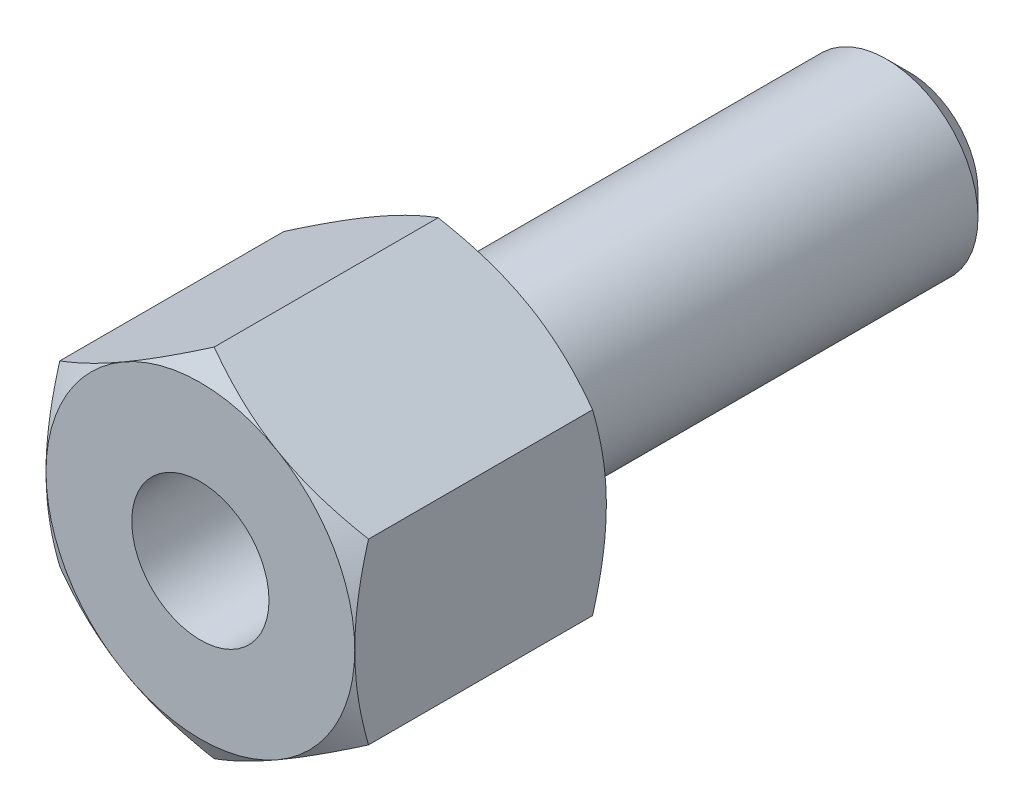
ISO-10303-21;
HEADER;
FILE_DESCRIPTION(('STEP AP214'),'2;1');
FILE_NAME('part.step','',(''),(''),'','','');
FILE_SCHEMA(('AUTOMOTIVE_DESIGN { 1 0 10303 214 1 1 1 1 }'));
ENDSEC;
DATA;
#1=APPLICATION_CONTEXT('core data for automotive mechanical design processes');
#2=APPLICATION_PROTOCOL_DEFINITION('international standard','automotive_design',2000,#1);
#3=PRODUCT_CONTEXT('',#1,'mechanical');
#4=PRODUCT('Part','Part','',(#3));
#5=PRODUCT_RELATED_PRODUCT_CATEGORY('part','',(#4));
#6=PRODUCT_DEFINITION_FORMATION('','',#4);
#7=PRODUCT_DEFINITION_CONTEXT('part definition',#1,'design');
#8=PRODUCT_DEFINITION('design','',#6,#7);
#9=PRODUCT_DEFINITION_SHAPE('','',#8);
#10=(LENGTH_UNIT() NAMED_UNIT(*) SI_UNIT(.MILLI.,.METRE.));
#11=(NAMED_UNIT(*) PLANE_ANGLE_UNIT() SI_UNIT($,.RADIAN.));
#12=(NAMED_UNIT(*) SI_UNIT($,.STERADIAN.) SOLID_ANGLE_UNIT());
#13=UNCERTAINTY_MEASURE_WITH_UNIT(LENGTH_MEASURE(1.E-05),#10,'distance_accuracy_value','');
#14=(GEOMETRIC_REPRESENTATION_CONTEXT(3) GLOBAL_UNCERTAINTY_ASSIGNED_CONTEXT((#13)) GLOBAL_UNIT_ASSIGNED_CONTEXT((#10,
#11,#12)) REPRESENTATION_CONTEXT('',''));
#15=CARTESIAN_POINT('',(0.,0.,0.));
#16=DIRECTION('',(0.,0.,1.));
#17=DIRECTION('',(1.,0.,0.));
#18=AXIS2_PLACEMENT_3D('',#15,#16,#17);
#19=CARTESIAN_POINT('',(13.5,7.79422863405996,22.));
#20=DIRECTION('',(-0.5,-0.866025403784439,0.));
#21=DIRECTION('',(0.866025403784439,-0.5,0.));
#22=AXIS2_PLACEMENT_3D('',#19,#20,#21);
#23=PLANE('',#22);
#24=CARTESIAN_POINT('',(-0.000200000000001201,15.5885727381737,1.20583803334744));
#25=CARTESIAN_POINT('',(0.296524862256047,15.417258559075,1.10693600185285));
#26=CARTESIAN_POINT('',(0.594407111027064,15.2452761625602,1.0125219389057));
#27=CARTESIAN_POINT('',(1.19256027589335,14.899932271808,0.833917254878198));
#28=CARTESIAN_POINT('',(1.49283194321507,14.7265703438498,0.749729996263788));
#29=CARTESIAN_POINT('',(2.09634426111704,14.3781323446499,0.59271056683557));
#30=CARTESIAN_POINT('',(2.39959019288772,14.2030532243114,0.519905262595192));
#31=CARTESIAN_POINT('',(3.00818925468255,13.8516783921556,0.387213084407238));
#32=CARTESIAN_POINT('',(3.31354226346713,13.675382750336,0.327325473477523));
#33=CARTESIAN_POINT('',(3.91853115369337,13.3260922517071,0.223015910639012));
#34=CARTESIAN_POINT('',(4.21812211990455,13.1531233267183,0.178248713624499));
#35=CARTESIAN_POINT('',(4.81867684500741,12.8063928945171,0.103183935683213));
#36=CARTESIAN_POINT('',(5.11964063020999,12.632631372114,0.0728866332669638));
#37=CARTESIAN_POINT('',(5.72207378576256,12.284816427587,0.0275266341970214));
#38=CARTESIAN_POINT('',(6.02354212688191,12.1107635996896,0.0124458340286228));
#39=CARTESIAN_POINT('',(6.62675710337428,11.7624972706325,-0.0021568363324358));
#40=CARTESIAN_POINT('',(6.92850372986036,11.5882837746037,-0.00167918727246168));
#41=CARTESIAN_POINT('',(7.49261810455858,11.262592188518,0.0137483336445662));
#42=CARTESIAN_POINT('',(7.75502605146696,11.1110908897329,0.0268164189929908));
#43=CARTESIAN_POINT('',(8.2792383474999,10.8084367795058,0.0644725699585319));
#44=CARTESIAN_POINT('',(8.54104265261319,10.6572839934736,0.0890614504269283));
#45=CARTESIAN_POINT('',(9.06390546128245,10.3554090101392,0.149330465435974));
#46=CARTESIAN_POINT('',(9.3249631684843,10.2046872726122,0.185019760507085));
#47=CARTESIAN_POINT('',(9.84585469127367,9.90395041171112,0.26686343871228));
#48=CARTESIAN_POINT('',(10.1056884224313,9.7539353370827,0.313018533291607));
#49=CARTESIAN_POINT('',(10.8944281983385,9.29855621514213,0.468349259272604));
#50=CARTESIAN_POINT('',(11.4210501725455,8.99451087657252,0.593013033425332));
#51=CARTESIAN_POINT('',(12.4664415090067,8.39095390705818,0.875948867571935));
#52=CARTESIAN_POINT('',(12.9852242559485,8.09143454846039,1.03415447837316));
#53=CARTESIAN_POINT('',(13.5002,7.79411316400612,1.20583803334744));
#54=B_SPLINE_CURVE_WITH_KNOTS('',3,(#24,#25,#26,#27,#28,#29,#30,#31,#32,#33,#34,#35,#36,#37,#38,
#39,#40,#41,#42,#43,#44,#45,#46,#47,#48,#49,#50,#51,#52,#53),.UNSPECIFIED.,.F.,.F.,(4,2,2,2,2,2,
2,2,2,2,2,2,2,2,4),(0.,1.06987949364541,2.14010980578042,3.21282939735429,4.28548777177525,
5.33167033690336,6.37787303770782,7.42282956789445,8.46775380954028,9.37738732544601,
10.2870851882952,11.1975357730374,12.1080482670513,13.9691139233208,15.8265265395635),.UNSPECIFIED.);
#55=CARTESIAN_POINT('',(0.,15.5884572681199,1.20577136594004));
#56=VERTEX_POINT('',#55);
#57=CARTESIAN_POINT('',(6.75,11.6913429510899,0.));
#58=VERTEX_POINT('',#57);
#59=EDGE_CURVE('E29',#56,#58,#54,.T.);
#60=ORIENTED_EDGE('',*,*,#59,.F.);
#61=DIRECTION('',(0.,0.,-1.));
#62=VECTOR('',#61,1.);
#63=CARTESIAN_POINT('',(0.,15.5884572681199,22.));
#64=LINE('',#63,#62);
#65=CARTESIAN_POINT('',(0.,15.5884572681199,20.79422863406));
#66=VERTEX_POINT('',#65);
#67=EDGE_CURVE('E288',#66,#56,#64,.T.);
#68=ORIENTED_EDGE('',*,*,#67,.F.);
#69=CARTESIAN_POINT('',(13.5002,7.79411316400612,20.7941619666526));
#70=CARTESIAN_POINT('',(13.2034751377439,7.96542734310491,20.8930639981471));
#71=CARTESIAN_POINT('',(12.9055928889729,8.13740973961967,20.9874780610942));
#72=CARTESIAN_POINT('',(12.3074397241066,8.48275363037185,21.1660827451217));
#73=CARTESIAN_POINT('',(12.0071680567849,8.65611555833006,21.2502700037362));
#74=CARTESIAN_POINT('',(11.403655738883,9.00455355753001,21.4072894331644));
#75=CARTESIAN_POINT('',(11.1004098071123,9.17963267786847,21.4800947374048));
#76=CARTESIAN_POINT('',(10.4918107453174,9.53100751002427,21.6127869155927));
#77=CARTESIAN_POINT('',(10.1864577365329,9.70730315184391,21.6726745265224));
#78=CARTESIAN_POINT('',(9.58146884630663,10.0565936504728,21.7769840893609));
#79=CARTESIAN_POINT('',(9.28187788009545,10.2295625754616,21.8217512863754));
#80=CARTESIAN_POINT('',(8.68132315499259,10.5762930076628,21.8968160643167));
#81=CARTESIAN_POINT('',(8.38035936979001,10.7500545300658,21.927113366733));
#82=CARTESIAN_POINT('',(7.77792621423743,11.0978694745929,21.9724733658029));
#83=CARTESIAN_POINT('',(7.47645787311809,11.2719223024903,21.9875541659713));
#84=CARTESIAN_POINT('',(6.87324289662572,11.6201886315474,22.0021568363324));
#85=CARTESIAN_POINT('',(6.57149627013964,11.7944021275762,22.0016791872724));
#86=CARTESIAN_POINT('',(6.00738189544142,12.1200937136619,21.9862516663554));
#87=CARTESIAN_POINT('',(5.74497394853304,12.271595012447,21.973183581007));
#88=CARTESIAN_POINT('',(5.22076165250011,12.5742491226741,21.9355274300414));
#89=CARTESIAN_POINT('',(4.95895734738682,12.7254019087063,21.910938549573));
#90=CARTESIAN_POINT('',(4.43609453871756,13.0272768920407,21.850669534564));
#91=CARTESIAN_POINT('',(4.17503683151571,13.1779986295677,21.8149802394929));
#92=CARTESIAN_POINT('',(3.65414530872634,13.4787354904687,21.7331365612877));
#93=CARTESIAN_POINT('',(3.39431157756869,13.6287505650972,21.6869814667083));
#94=CARTESIAN_POINT('',(2.60557180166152,14.0841296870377,21.5316507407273));
#95=CARTESIAN_POINT('',(2.07894982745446,14.3881750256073,21.4069869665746));
#96=CARTESIAN_POINT('',(1.03355849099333,14.9917319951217,21.124051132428));
#97=CARTESIAN_POINT('',(0.514775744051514,15.2912513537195,20.9658455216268));
#98=CARTESIAN_POINT('',(-0.000200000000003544,15.5885727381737,20.7941619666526));
#99=B_SPLINE_CURVE_WITH_KNOTS('',3,(#69,#70,#71,#72,#73,#74,#75,#76,#77,#78,#79,#80,#81,#82,#83,
#84,#85,#86,#87,#88,#89,#90,#91,#92,#93,#94,#95,#96,#97,#98),.UNSPECIFIED.,.F.,.F.,(4,2,2,2,2,2,
2,2,2,2,2,2,2,2,4),(0.,1.0698794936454,2.14010980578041,3.21282939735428,4.28548777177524,
5.33167033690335,6.37787303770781,7.42282956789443,8.46775380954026,9.37738732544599,
10.2870851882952,11.1975357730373,12.1080482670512,13.9691139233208,15.8265265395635),.UNSPECIFIED.);
#100=CARTESIAN_POINT('',(6.75,11.6913429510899,22.));
#101=VERTEX_POINT('',#100);
#102=EDGE_CURVE('E219',#101,#66,#99,.T.);
#103=ORIENTED_EDGE('',*,*,#102,.F.);
#104=CARTESIAN_POINT('',(13.5,7.79422863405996,20.79422863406));
#105=VERTEX_POINT('',#104);
#106=EDGE_CURVE('E224',#105,#101,#99,.T.);
#107=ORIENTED_EDGE('',*,*,#106,.F.);
#108=DIRECTION('',(0.,0.,-1.));
#109=VECTOR('',#108,1.);
#110=CARTESIAN_POINT('',(13.5,7.79422863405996,22.));
#111=LINE('',#110,#109);
#112=CARTESIAN_POINT('',(13.5,7.79422863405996,1.20577136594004));
#113=VERTEX_POINT('',#112);
#114=EDGE_CURVE('E282',#105,#113,#111,.T.);
#115=ORIENTED_EDGE('',*,*,#114,.T.);
#116=EDGE_CURVE('E111',#58,#113,#54,.T.);
#117=ORIENTED_EDGE('',*,*,#116,.F.);
#118=EDGE_LOOP('',(#60,#68,#103,#107,#115,#117));
#119=FACE_BOUND('',#118,.T.);
#120=ADVANCED_FACE('F14',(#119),#23,.F.);
#121=CARTESIAN_POINT('',(13.5,-7.79422863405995,22.));
#122=DIRECTION('',(-1.,0.,0.));
#123=DIRECTION('',(0.,-1.,0.));
#124=AXIS2_PLACEMENT_3D('',#121,#122,#123);
#125=PLANE('',#124);
#126=CARTESIAN_POINT('',(13.5,-21.331355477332,6.78059814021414));
#127=CARTESIAN_POINT('',(13.5,-21.0348415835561,6.63594408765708));
#128=CARTESIAN_POINT('',(13.5,-20.7379902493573,6.49198204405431));
#129=CARTESIAN_POINT('',(13.5,-20.1435424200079,6.20559795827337));
#130=CARTESIAN_POINT('',(13.5,-19.8459459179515,6.06317593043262));
#131=CARTESIAN_POINT('',(13.5,-18.9518592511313,5.63841878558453));
#132=CARTESIAN_POINT('',(13.5,-18.3541537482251,5.35863262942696));
#133=CARTESIAN_POINT('',(13.5,-17.1518047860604,4.80605287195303));
#134=CARTESIAN_POINT('',(13.5,-16.5471414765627,4.53330236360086));
#135=CARTESIAN_POINT('',(13.5,-15.3331426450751,3.99844293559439));
#136=CARTESIAN_POINT('',(13.5,-14.7238073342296,3.73633353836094));
#137=CARTESIAN_POINT('',(13.5,-13.4783398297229,3.21673295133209));
#138=CARTESIAN_POINT('',(13.5,-12.8420094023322,2.95971454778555));
#139=CARTESIAN_POINT('',(13.5,-11.5620466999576,2.46418926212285));
#140=CARTESIAN_POINT('',(13.5,-10.9184136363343,2.22568440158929));
#141=CARTESIAN_POINT('',(13.5,-9.6239242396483,1.77316412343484));
#142=CARTESIAN_POINT('',(13.5,-8.97308423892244,1.5591023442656));
#143=CARTESIAN_POINT('',(13.5,-7.6620162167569,1.16206050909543));
#144=CARTESIAN_POINT('',(13.5,-7.00179109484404,0.979071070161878));
#145=CARTESIAN_POINT('',(13.5,-6.00612300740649,0.734821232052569));
#146=CARTESIAN_POINT('',(13.5,-5.67432480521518,0.658623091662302));
#147=CARTESIAN_POINT('',(13.5,-5.00839149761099,0.517171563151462));
#148=CARTESIAN_POINT('',(13.5,-4.67425643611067,0.451917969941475));
#149=CARTESIAN_POINT('',(13.5,-4.00385058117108,0.333481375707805));
#150=CARTESIAN_POINT('',(13.5,-3.66757983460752,0.280298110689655));
#151=CARTESIAN_POINT('',(13.5,-2.99322771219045,0.1870468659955));
#152=CARTESIAN_POINT('',(13.5,-2.65514641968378,0.146978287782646));
#153=CARTESIAN_POINT('',(13.5,-1.98222745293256,0.081277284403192));
#154=CARTESIAN_POINT('',(13.5,-1.64740837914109,0.0554555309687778));
#155=CARTESIAN_POINT('',(13.5,-0.976977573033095,0.0180091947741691));
#156=CARTESIAN_POINT('',(13.5,-0.641365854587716,0.00638436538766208));
#157=CARTESIAN_POINT('',(13.5,0.0300490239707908,-0.00238931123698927));
#158=CARTESIAN_POINT('',(13.5,0.365852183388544,0.00046178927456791));
#159=CARTESIAN_POINT('',(13.5,1.03703053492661,0.0205660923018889));
#160=CARTESIAN_POINT('',(13.5,1.37240570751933,0.0378199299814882));
#161=CARTESIAN_POINT('',(13.5,2.16676258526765,0.0953698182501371));
#162=CARTESIAN_POINT('',(13.5,2.6253067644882,0.141850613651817));
#163=CARTESIAN_POINT('',(13.5,3.53922491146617,0.259287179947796));
#164=CARTESIAN_POINT('',(13.5,3.99459848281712,0.330245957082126));
#165=CARTESIAN_POINT('',(13.5,5.35531317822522,0.57609614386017));
#166=CARTESIAN_POINT('',(13.5,6.25479537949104,0.78392404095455));
#167=CARTESIAN_POINT('',(13.5,7.60029912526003,1.14728943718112));
#168=CARTESIAN_POINT('',(13.5,8.05321725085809,1.27878575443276));
#169=CARTESIAN_POINT('',(13.5,8.95466371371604,1.55618422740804));
#170=CARTESIAN_POINT('',(13.5,9.40319201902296,1.70208648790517));
#171=CARTESIAN_POINT('',(13.5,10.295985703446,2.00589462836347));
#172=CARTESIAN_POINT('',(13.5,10.7402522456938,2.16379712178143));
#173=CARTESIAN_POINT('',(13.5,11.6250550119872,2.48967378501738));
#174=CARTESIAN_POINT('',(13.5,12.0655913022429,2.65764777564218));
#175=CARTESIAN_POINT('',(13.5,13.183719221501,3.09631129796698));
#176=CARTESIAN_POINT('',(13.5,13.8590041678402,3.37287276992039));
#177=CARTESIAN_POINT('',(13.5,15.203081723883,3.9413978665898));
#178=CARTESIAN_POINT('',(13.5,15.8718737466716,4.23336286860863));
#179=CARTESIAN_POINT('',(13.5,17.2043213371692,4.82931020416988));
#180=CARTESIAN_POINT('',(13.5,17.8679751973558,5.13329634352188));
#181=CARTESIAN_POINT('',(13.5,19.1908824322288,5.75061518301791));
#182=CARTESIAN_POINT('',(13.5,19.8501359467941,6.06394758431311));
#183=CARTESIAN_POINT('',(13.5,21.1659794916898,6.69850180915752));
#184=CARTESIAN_POINT('',(13.5,21.8225644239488,7.01973418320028));
#185=CARTESIAN_POINT('',(13.5,23.1327602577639,7.66820869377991));
#186=CARTESIAN_POINT('',(13.5,23.78637114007,7.99545086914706));
#187=CARTESIAN_POINT('',(13.5,25.0909986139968,8.65477087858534));
#188=CARTESIAN_POINT('',(13.5,25.742015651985,8.98684783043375));
#189=CARTESIAN_POINT('',(13.5,27.0419705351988,9.655038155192));
#190=CARTESIAN_POINT('',(13.5,27.6909083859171,9.9911515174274));
#191=CARTESIAN_POINT('',(13.5,29.5104700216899,10.9395467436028));
#192=CARTESIAN_POINT('',(13.5,30.6791164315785,11.5556218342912));
#193=CARTESIAN_POINT('',(13.5,33.0122022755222,12.7958093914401));
#194=CARTESIAN_POINT('',(13.5,34.1766414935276,13.4199222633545));
#195=CARTESIAN_POINT('',(13.5,36.4986615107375,14.6722739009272));
#196=CARTESIAN_POINT('',(13.5,37.6562523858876,15.3004939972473));
#197=CARTESIAN_POINT('',(13.5,39.3906904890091,16.2462971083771));
#198=CARTESIAN_POINT('',(13.5,39.9684919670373,16.5621327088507));
#199=CARTESIAN_POINT('',(13.5,41.1235248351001,17.194842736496));
#200=CARTESIAN_POINT('',(13.5,41.7007562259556,17.5117171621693));
#201=CARTESIAN_POINT('',(13.5,42.2777363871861,17.8290485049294));
#202=B_SPLINE_CURVE_WITH_KNOTS('',3,(#126,#127,#128,#129,#130,#131,#132,#133,#134,#135,#136,
#137,#138,#139,#140,#141,#142,#143,#144,#145,#146,#147,#148,#149,#150,#151,#152,#153,#154,#155,
#156,#157,#158,#159,#160,#161,#162,#163,#164,#165,#166,#167,#168,#169,#170,#171,#172,#173,#174,
#175,#176,#177,#178,#179,#180,#181,#182,#183,#184,#185,#186,#187,#188,#189,#190,#191,#192,#193,
#194,#195,#196,#197,#198,#199,#200,#201),.UNSPECIFIED.,.F.,.F.,(4,2,2,2,2,2,2,2,2,2,2,2,2,2,2,2,
2,2,2,2,2,2,2,2,2,2,2,2,2,2,2,2,2,2,2,2,2,4),(0.,0.98974959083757,1.9795083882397,
3.95929922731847,5.94921788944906,7.93904714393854,9.99765533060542,12.0564879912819,
14.1113483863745,16.1655871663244,17.186741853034,18.2078774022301,19.2289906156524,
20.2500572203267,21.2572061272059,22.2643375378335,23.2714653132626,24.2786375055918,
25.6605465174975,27.0426253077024,29.8081400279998,31.2228732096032,32.6376166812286,
34.0519623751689,35.4662829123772,37.6551800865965,39.8442733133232,42.0340652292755,
44.2237872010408,46.416612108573,48.6094511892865,50.8018950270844,52.994333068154,
56.9575595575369,60.9209867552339,64.8721862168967,66.8476499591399,68.8231108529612),.UNSPECIFIED.);
#203=CARTESIAN_POINT('',(13.5,0.,0.));
#204=VERTEX_POINT('',#203);
#205=EDGE_CURVE('E104',#113,#204,#202,.F.);
#206=ORIENTED_EDGE('',*,*,#205,.F.);
#207=ORIENTED_EDGE('',*,*,#114,.F.);
#208=CARTESIAN_POINT('',(13.5,-21.331355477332,15.2194018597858));
#209=CARTESIAN_POINT('',(13.5,-21.0348415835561,15.3640559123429));
#210=CARTESIAN_POINT('',(13.5,-20.7379902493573,15.5080179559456));
#211=CARTESIAN_POINT('',(13.5,-20.1435424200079,15.7944020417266));
#212=CARTESIAN_POINT('',(13.5,-19.8459459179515,15.9368240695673));
#213=CARTESIAN_POINT('',(13.5,-18.9518592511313,16.3615812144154));
#214=CARTESIAN_POINT('',(13.5,-18.3541537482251,16.641367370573));
#215=CARTESIAN_POINT('',(13.5,-17.1518047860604,17.1939471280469));
#216=CARTESIAN_POINT('',(13.5,-16.5471414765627,17.4666976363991));
#217=CARTESIAN_POINT('',(13.5,-15.333142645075,18.0015570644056));
#218=CARTESIAN_POINT('',(13.5,-14.7238073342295,18.263666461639));
#219=CARTESIAN_POINT('',(13.5,-13.4783398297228,18.7832670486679));
#220=CARTESIAN_POINT('',(13.5,-12.8420094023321,19.0402854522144));
#221=CARTESIAN_POINT('',(13.5,-11.5620466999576,19.5358107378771));
#222=CARTESIAN_POINT('',(13.5,-10.9184136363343,19.7743155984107));
#223=CARTESIAN_POINT('',(13.5,-9.62392423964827,20.2268358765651));
#224=CARTESIAN_POINT('',(13.5,-8.9730842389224,20.4408976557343));
#225=CARTESIAN_POINT('',(13.5,-7.66201621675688,20.8379394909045));
#226=CARTESIAN_POINT('',(13.5,-7.00179109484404,21.0209289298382));
#227=CARTESIAN_POINT('',(13.5,-6.00612300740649,21.2651787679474));
#228=CARTESIAN_POINT('',(13.5,-5.67432480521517,21.3413769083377));
#229=CARTESIAN_POINT('',(13.5,-5.00839149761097,21.4828284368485));
#230=CARTESIAN_POINT('',(13.5,-4.67425643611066,21.5480820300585));
#231=CARTESIAN_POINT('',(13.5,-4.00385058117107,21.6665186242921));
#232=CARTESIAN_POINT('',(13.5,-3.66757983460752,21.7197018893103));
#233=CARTESIAN_POINT('',(13.5,-2.99322771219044,21.8129531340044));
#234=CARTESIAN_POINT('',(13.5,-2.65514641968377,21.8530217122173));
#235=CARTESIAN_POINT('',(13.5,-1.98222745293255,21.9187227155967));
#236=CARTESIAN_POINT('',(13.5,-1.64740837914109,21.9445444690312));
#237=CARTESIAN_POINT('',(13.5,-0.976977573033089,21.9819908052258));
#238=CARTESIAN_POINT('',(13.5,-0.641365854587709,21.9936156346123));
#239=CARTESIAN_POINT('',(13.5,0.0300490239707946,22.0023893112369));
#240=CARTESIAN_POINT('',(13.5,0.365852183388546,21.9995382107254));
#241=CARTESIAN_POINT('',(13.5,1.03703053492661,21.9794339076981));
#242=CARTESIAN_POINT('',(13.5,1.37240570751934,21.9621800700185));
#243=CARTESIAN_POINT('',(13.5,2.16676258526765,21.9046301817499));
#244=CARTESIAN_POINT('',(13.5,2.62530676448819,21.8581493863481));
#245=CARTESIAN_POINT('',(13.5,3.53922491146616,21.7407128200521));
#246=CARTESIAN_POINT('',(13.5,3.9945984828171,21.6697540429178));
#247=CARTESIAN_POINT('',(13.5,5.3553131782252,21.4239038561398));
#248=CARTESIAN_POINT('',(13.5,6.25479537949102,21.2160759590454));
#249=CARTESIAN_POINT('',(13.5,7.60029912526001,20.8527105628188));
#250=CARTESIAN_POINT('',(13.5,8.05321725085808,20.7212142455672));
#251=CARTESIAN_POINT('',(13.5,8.95466371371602,20.4438157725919));
#252=CARTESIAN_POINT('',(13.5,9.40319201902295,20.2979135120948));
#253=CARTESIAN_POINT('',(13.5,10.295985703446,19.9941053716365));
#254=CARTESIAN_POINT('',(13.5,10.7402522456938,19.8362028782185));
#255=CARTESIAN_POINT('',(13.5,11.6250550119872,19.5103262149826));
#256=CARTESIAN_POINT('',(13.5,12.0655913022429,19.3423522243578));
#257=CARTESIAN_POINT('',(13.5,13.183719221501,18.9036887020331));
#258=CARTESIAN_POINT('',(13.5,13.8590041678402,18.6271272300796));
#259=CARTESIAN_POINT('',(13.5,15.203081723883,18.0586021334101));
#260=CARTESIAN_POINT('',(13.5,15.8718737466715,17.7666371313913));
#261=CARTESIAN_POINT('',(13.5,17.2043213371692,17.1706897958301));
#262=CARTESIAN_POINT('',(13.5,17.8679751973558,16.8667036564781));
#263=CARTESIAN_POINT('',(13.5,19.1908824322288,16.2493848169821));
#264=CARTESIAN_POINT('',(13.5,19.850135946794,15.9360524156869));
#265=CARTESIAN_POINT('',(13.5,21.1659794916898,15.3014981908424));
#266=CARTESIAN_POINT('',(13.5,21.8225644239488,14.9802658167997));
#267=CARTESIAN_POINT('',(13.5,23.1327602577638,14.3317913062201));
#268=CARTESIAN_POINT('',(13.5,23.7863711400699,14.0045491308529));
#269=CARTESIAN_POINT('',(13.5,25.0909986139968,13.3452291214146));
#270=CARTESIAN_POINT('',(13.5,25.742015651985,13.0131521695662));
#271=CARTESIAN_POINT('',(13.5,27.0419705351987,12.344961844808));
#272=CARTESIAN_POINT('',(13.5,27.6909083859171,12.0088484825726));
#273=CARTESIAN_POINT('',(13.5,29.5104700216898,11.0604532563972));
#274=CARTESIAN_POINT('',(13.5,30.6791164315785,10.4443781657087));
#275=CARTESIAN_POINT('',(13.5,33.0122022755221,9.20419060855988));
#276=CARTESIAN_POINT('',(13.5,34.1766414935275,8.58007773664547));
#277=CARTESIAN_POINT('',(13.5,36.4986615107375,7.32772609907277));
#278=CARTESIAN_POINT('',(13.5,37.6562523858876,6.69950600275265));
#279=CARTESIAN_POINT('',(13.5,39.3906904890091,5.7537028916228));
#280=CARTESIAN_POINT('',(13.5,39.9684919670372,5.43786729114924));
#281=CARTESIAN_POINT('',(13.5,41.1235248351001,4.8051572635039));
#282=CARTESIAN_POINT('',(13.5,41.7007562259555,4.48828283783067));
#283=CARTESIAN_POINT('',(13.5,42.2777363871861,4.17095149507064));
#284=B_SPLINE_CURVE_WITH_KNOTS('',3,(#208,#209,#210,#211,#212,#213,#214,#215,#216,#217,#218,
#219,#220,#221,#222,#223,#224,#225,#226,#227,#228,#229,#230,#231,#232,#233,#234,#235,#236,#237,
#238,#239,#240,#241,#242,#243,#244,#245,#246,#247,#248,#249,#250,#251,#252,#253,#254,#255,#256,
#257,#258,#259,#260,#261,#262,#263,#264,#265,#266,#267,#268,#269,#270,#271,#272,#273,#274,#275,
#276,#277,#278,#279,#280,#281,#282,#283),.UNSPECIFIED.,.F.,.F.,(4,2,2,2,2,2,2,2,2,2,2,2,2,2,2,2,
2,2,2,2,2,2,2,2,2,2,2,2,2,2,2,2,2,2,2,2,2,4),(0.,0.989749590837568,1.9795083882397,
3.95929922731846,5.94921788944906,7.93904714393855,9.99765533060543,12.0564879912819,
14.1113483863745,16.1655871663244,17.186741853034,18.2078774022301,19.2289906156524,
20.2500572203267,21.2572061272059,22.2643375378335,23.2714653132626,24.2786375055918,
25.6605465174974,27.0426253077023,29.8081400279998,31.2228732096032,32.6376166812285,
34.0519623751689,35.4662829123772,37.6551800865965,39.8442733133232,42.0340652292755,
44.2237872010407,46.4166121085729,48.6094511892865,50.8018950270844,52.9943330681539,
56.9575595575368,60.9209867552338,64.8721862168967,66.8476499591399,68.8231108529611),.UNSPECIFIED.);
#285=CARTESIAN_POINT('',(13.5,0.,22.));
#286=VERTEX_POINT('',#285);
#287=EDGE_CURVE('E170',#286,#105,#284,.T.);
#288=ORIENTED_EDGE('',*,*,#287,.F.);
#289=CARTESIAN_POINT('',(13.5,-7.79422863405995,20.79422863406));
#290=VERTEX_POINT('',#289);
#291=EDGE_CURVE('E177',#290,#286,#284,.T.);
#292=ORIENTED_EDGE('',*,*,#291,.F.);
#293=DIRECTION('',(0.,0.,-1.));
#294=VECTOR('',#293,1.);
#295=CARTESIAN_POINT('',(13.5,-7.79422863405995,22.));
#296=LINE('',#295,#294);
#297=CARTESIAN_POINT('',(13.5,-7.79422863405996,1.20577136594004));
#298=VERTEX_POINT('',#297);
#299=EDGE_CURVE('E136',#290,#298,#296,.T.);
#300=ORIENTED_EDGE('',*,*,#299,.T.);
#301=EDGE_CURVE('E116',#204,#298,#202,.F.);
#302=ORIENTED_EDGE('',*,*,#301,.F.);
#303=EDGE_LOOP('',(#206,#207,#288,#292,#300,#302));
#304=FACE_BOUND('',#303,.T.);
#305=ADVANCED_FACE('F133',(#304),#125,.F.);
#306=CARTESIAN_POINT('',(0.,-15.5884572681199,22.));
#307=DIRECTION('',(-0.5,0.866025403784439,0.));
#308=DIRECTION('',(-0.866025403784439,-0.5,0.));
#309=AXIS2_PLACEMENT_3D('',#306,#307,#308);
#310=PLANE('',#309);
#311=CARTESIAN_POINT('',(13.5002,-7.79411316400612,1.20583803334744));
#312=CARTESIAN_POINT('',(13.203475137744,-7.9654273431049,1.10693600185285));
#313=CARTESIAN_POINT('',(12.9055928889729,-8.13740973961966,1.0125219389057));
#314=CARTESIAN_POINT('',(12.3074397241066,-8.48275363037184,0.833917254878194));
#315=CARTESIAN_POINT('',(12.0071680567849,-8.65611555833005,0.749729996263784));
#316=CARTESIAN_POINT('',(11.403655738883,-9.00455355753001,0.592710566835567));
#317=CARTESIAN_POINT('',(11.1004098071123,-9.17963267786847,0.519905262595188));
#318=CARTESIAN_POINT('',(10.4918107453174,-9.53100751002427,0.387213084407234));
#319=CARTESIAN_POINT('',(10.1864577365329,-9.7073031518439,0.327325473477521));
#320=CARTESIAN_POINT('',(9.58146884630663,-10.0565936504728,0.22301591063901));
#321=CARTESIAN_POINT('',(9.28187788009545,-10.2295625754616,0.178248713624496));
#322=CARTESIAN_POINT('',(8.68132315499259,-10.5762930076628,0.103183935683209));
#323=CARTESIAN_POINT('',(8.38035936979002,-10.7500545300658,0.0728866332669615));
#324=CARTESIAN_POINT('',(7.77792621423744,-11.0978694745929,0.0275266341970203));
#325=CARTESIAN_POINT('',(7.4764578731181,-11.2719223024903,0.0124458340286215));
#326=CARTESIAN_POINT('',(6.87324289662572,-11.6201886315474,-0.00215683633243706));
#327=CARTESIAN_POINT('',(6.57149627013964,-11.7944021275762,-0.00167918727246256));
#328=CARTESIAN_POINT('',(6.00738189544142,-12.1200937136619,0.0137483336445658));
#329=CARTESIAN_POINT('',(5.74497394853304,-12.271595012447,0.0268164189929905));
#330=CARTESIAN_POINT('',(5.2207616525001,-12.5742491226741,0.0644725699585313));
#331=CARTESIAN_POINT('',(4.95895734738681,-12.7254019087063,0.0890614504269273));
#332=CARTESIAN_POINT('',(4.43609453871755,-13.0272768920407,0.149330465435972));
#333=CARTESIAN_POINT('',(4.1750368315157,-13.1779986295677,0.185019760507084));
#334=CARTESIAN_POINT('',(3.65414530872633,-13.4787354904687,0.266863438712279));
#335=CARTESIAN_POINT('',(3.39431157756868,-13.6287505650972,0.313018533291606));
#336=CARTESIAN_POINT('',(2.60557180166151,-14.0841296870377,0.468349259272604));
#337=CARTESIAN_POINT('',(2.07894982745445,-14.3881750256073,0.593013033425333));
#338=CARTESIAN_POINT('',(1.03355849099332,-14.9917319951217,0.875948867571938));
#339=CARTESIAN_POINT('',(0.514775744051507,-15.2912513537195,1.03415447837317));
#340=CARTESIAN_POINT('',(-0.000200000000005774,-15.5885727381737,1.20583803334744));
#341=B_SPLINE_CURVE_WITH_KNOTS('',3,(#311,#312,#313,#314,#315,#316,#317,#318,#319,#320,#321,
#322,#323,#324,#325,#326,#327,#328,#329,#330,#331,#332,#333,#334,#335,#336,#337,#338,#339,#340),
.UNSPECIFIED.,.F.,.F.,(4,2,2,2,2,2,2,2,2,2,2,2,2,2,4),(0.,1.06987949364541,2.14010980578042,
3.21282939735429,4.28548777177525,5.33167033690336,6.37787303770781,7.42282956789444,
8.46775380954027,9.377387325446,10.2870851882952,11.1975357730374,12.1080482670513,
13.9691139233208,15.8265265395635),.UNSPECIFIED.);
#342=CARTESIAN_POINT('',(6.75,-11.6913429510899,0.));
#343=VERTEX_POINT('',#342);
#344=EDGE_CURVE('E123',#298,#343,#341,.T.);
#345=ORIENTED_EDGE('',*,*,#344,.F.);
#346=ORIENTED_EDGE('',*,*,#299,.F.);
#347=CARTESIAN_POINT('',(-0.000200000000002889,-15.5885727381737,20.7941619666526));
#348=CARTESIAN_POINT('',(0.29652486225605,-15.417258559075,20.8930639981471));
#349=CARTESIAN_POINT('',(0.594407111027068,-15.2452761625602,20.9874780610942));
#350=CARTESIAN_POINT('',(1.19256027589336,-14.899932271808,21.1660827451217));
#351=CARTESIAN_POINT('',(1.49283194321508,-14.7265703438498,21.2502700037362));
#352=CARTESIAN_POINT('',(2.09634426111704,-14.3781323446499,21.4072894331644));
#353=CARTESIAN_POINT('',(2.39959019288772,-14.2030532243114,21.4800947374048));
#354=CARTESIAN_POINT('',(3.00818925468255,-13.8516783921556,21.6127869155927));
#355=CARTESIAN_POINT('',(3.31354226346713,-13.675382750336,21.6726745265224));
#356=CARTESIAN_POINT('',(3.91853115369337,-13.3260922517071,21.7769840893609));
#357=CARTESIAN_POINT('',(4.21812211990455,-13.1531233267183,21.8217512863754));
#358=CARTESIAN_POINT('',(4.81867684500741,-12.8063928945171,21.8968160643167));
#359=CARTESIAN_POINT('',(5.11964063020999,-12.632631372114,21.927113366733));
#360=CARTESIAN_POINT('',(5.72207378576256,-12.284816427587,21.9724733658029));
#361=CARTESIAN_POINT('',(6.0235421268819,-12.1107635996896,21.9875541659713));
#362=CARTESIAN_POINT('',(6.62675710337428,-11.7624972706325,22.0021568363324));
#363=CARTESIAN_POINT('',(6.92850372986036,-11.5882837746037,22.0016791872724));
#364=CARTESIAN_POINT('',(7.49261810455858,-11.262592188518,21.9862516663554));
#365=CARTESIAN_POINT('',(7.75502605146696,-11.1110908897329,21.973183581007));
#366=CARTESIAN_POINT('',(8.27923834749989,-10.8084367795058,21.9355274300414));
#367=CARTESIAN_POINT('',(8.54104265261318,-10.6572839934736,21.910938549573));
#368=CARTESIAN_POINT('',(9.06390546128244,-10.3554090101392,21.850669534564));
#369=CARTESIAN_POINT('',(9.32496316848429,-10.2046872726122,21.8149802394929));
#370=CARTESIAN_POINT('',(9.84585469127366,-9.90395041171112,21.7331365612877));
#371=CARTESIAN_POINT('',(10.1056884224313,-9.7539353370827,21.6869814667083));
#372=CARTESIAN_POINT('',(10.8944281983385,-9.29855621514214,21.5316507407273));
#373=CARTESIAN_POINT('',(11.4210501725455,-8.99451087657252,21.4069869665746));
#374=CARTESIAN_POINT('',(12.4664415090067,-8.39095390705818,21.124051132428));
#375=CARTESIAN_POINT('',(12.9852242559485,-8.09143454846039,20.9658455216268));
#376=CARTESIAN_POINT('',(13.5002,-7.79411316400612,20.7941619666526));
#377=B_SPLINE_CURVE_WITH_KNOTS('',3,(#347,#348,#349,#350,#351,#352,#353,#354,#355,#356,#357,
#358,#359,#360,#361,#362,#363,#364,#365,#366,#367,#368,#369,#370,#371,#372,#373,#374,#375,#376),
.UNSPECIFIED.,.F.,.F.,(4,2,2,2,2,2,2,2,2,2,2,2,2,2,4),(0.,1.0698794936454,2.14010980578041,
3.21282939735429,4.28548777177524,5.33167033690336,6.37787303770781,7.42282956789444,
8.46775380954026,9.37738732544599,10.2870851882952,11.1975357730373,12.1080482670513,
13.9691139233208,15.8265265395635),.UNSPECIFIED.);
#378=CARTESIAN_POINT('',(6.75,-11.6913429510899,22.));
#379=VERTEX_POINT('',#378);
#380=EDGE_CURVE('E184',#379,#290,#377,.T.);
#381=ORIENTED_EDGE('',*,*,#380,.F.);
#382=CARTESIAN_POINT('',(0.,-15.5884572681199,20.79422863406));
#383=VERTEX_POINT('',#382);
#384=EDGE_CURVE('E277',#383,#379,#377,.T.);
#385=ORIENTED_EDGE('',*,*,#384,.F.);
#386=DIRECTION('',(0.,0.,-1.));
#387=VECTOR('',#386,1.);
#388=CARTESIAN_POINT('',(0.,-15.5884572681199,22.));
#389=LINE('',#388,#387);
#390=CARTESIAN_POINT('',(0.,-15.5884572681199,1.20577136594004));
#391=VERTEX_POINT('',#390);
#392=EDGE_CURVE('E272',#383,#391,#389,.T.);
#393=ORIENTED_EDGE('',*,*,#392,.T.);
#394=EDGE_CURVE('E137',#343,#391,#341,.T.);
#395=ORIENTED_EDGE('',*,*,#394,.F.);
#396=EDGE_LOOP('',(#345,#346,#381,#385,#393,#395));
#397=FACE_BOUND('',#396,.T.);
#398=ADVANCED_FACE('F163',(#397),#310,.F.);
#399=CARTESIAN_POINT('',(-13.5,-7.79422863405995,22.));
#400=DIRECTION('',(0.5,0.866025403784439,0.));
#401=DIRECTION('',(-0.866025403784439,0.5,0.));
#402=AXIS2_PLACEMENT_3D('',#399,#400,#401);
#403=PLANE('',#402);
#404=CARTESIAN_POINT('',(0.000199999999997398,-15.5885727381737,1.20583803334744));
#405=CARTESIAN_POINT('',(-0.296524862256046,-15.417258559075,1.10693600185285));
#406=CARTESIAN_POINT('',(-0.594407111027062,-15.2452761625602,1.0125219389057));
#407=CARTESIAN_POINT('',(-1.19256027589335,-14.899932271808,0.833917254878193));
#408=CARTESIAN_POINT('',(-1.49283194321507,-14.7265703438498,0.749729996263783));
#409=CARTESIAN_POINT('',(-2.09634426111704,-14.3781323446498,0.592710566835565));
#410=CARTESIAN_POINT('',(-2.39959019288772,-14.2030532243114,0.519905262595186));
#411=CARTESIAN_POINT('',(-3.00818925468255,-13.8516783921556,0.387213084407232));
#412=CARTESIAN_POINT('',(-3.31354226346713,-13.6753827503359,0.327325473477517));
#413=CARTESIAN_POINT('',(-3.91853115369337,-13.3260922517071,0.223015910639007));
#414=CARTESIAN_POINT('',(-4.21812211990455,-13.1531233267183,0.178248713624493));
#415=CARTESIAN_POINT('',(-4.81867684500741,-12.8063928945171,0.103183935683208));
#416=CARTESIAN_POINT('',(-5.11964063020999,-12.632631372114,0.0728866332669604));
#417=CARTESIAN_POINT('',(-5.72207378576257,-12.284816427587,0.0275266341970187));
#418=CARTESIAN_POINT('',(-6.02354212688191,-12.1107635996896,0.0124458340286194));
#419=CARTESIAN_POINT('',(-6.62675710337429,-11.7624972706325,-0.00215683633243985));
#420=CARTESIAN_POINT('',(-6.92850372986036,-11.5882837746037,-0.00167918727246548));
#421=CARTESIAN_POINT('',(-7.49261810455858,-11.2625921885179,0.0137483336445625));
#422=CARTESIAN_POINT('',(-7.75502605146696,-11.1110908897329,0.0268164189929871));
#423=CARTESIAN_POINT('',(-8.2792383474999,-10.8084367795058,0.0644725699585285));
#424=CARTESIAN_POINT('',(-8.54104265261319,-10.6572839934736,0.0890614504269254));
#425=CARTESIAN_POINT('',(-9.06390546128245,-10.3554090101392,0.149330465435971));
#426=CARTESIAN_POINT('',(-9.3249631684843,-10.2046872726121,0.185019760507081));
#427=CARTESIAN_POINT('',(-9.84585469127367,-9.9039504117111,0.266863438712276));
#428=CARTESIAN_POINT('',(-10.1056884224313,-9.75393533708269,0.313018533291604));
#429=CARTESIAN_POINT('',(-10.8944281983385,-9.29855621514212,0.468349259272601));
#430=CARTESIAN_POINT('',(-11.4210501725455,-8.99451087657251,0.593013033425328));
#431=CARTESIAN_POINT('',(-12.4664415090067,-8.39095390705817,0.875948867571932));
#432=CARTESIAN_POINT('',(-12.9852242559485,-8.09143454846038,1.03415447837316));
#433=CARTESIAN_POINT('',(-13.5002,-7.79411316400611,1.20583803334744));
#434=B_SPLINE_CURVE_WITH_KNOTS('',3,(#404,#405,#406,#407,#408,#409,#410,#411,#412,#413,#414,
#415,#416,#417,#418,#419,#420,#421,#422,#423,#424,#425,#426,#427,#428,#429,#430,#431,#432,#433),
.UNSPECIFIED.,.F.,.F.,(4,2,2,2,2,2,2,2,2,2,2,2,2,2,4),(0.,1.06987949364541,2.14010980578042,
3.2128293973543,4.28548777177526,5.33167033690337,6.37787303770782,7.42282956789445,
8.46775380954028,9.37738732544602,10.2870851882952,11.1975357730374,12.1080482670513,
13.9691139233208,15.8265265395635),.UNSPECIFIED.);
#435=CARTESIAN_POINT('',(-6.75,-11.6913429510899,0.));
#436=VERTEX_POINT('',#435);
#437=EDGE_CURVE('E253',#391,#436,#434,.T.);
#438=ORIENTED_EDGE('',*,*,#437,.F.);
#439=ORIENTED_EDGE('',*,*,#392,.F.);
#440=CARTESIAN_POINT('',(-13.5002,-7.79411316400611,20.7941619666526));
#441=CARTESIAN_POINT('',(-13.2034751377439,-7.9654273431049,20.8930639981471));
#442=CARTESIAN_POINT('',(-12.9055928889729,-8.13740973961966,20.9874780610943));
#443=CARTESIAN_POINT('',(-12.3074397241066,-8.48275363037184,21.1660827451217));
#444=CARTESIAN_POINT('',(-12.0071680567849,-8.65611555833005,21.2502700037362));
#445=CARTESIAN_POINT('',(-11.403655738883,-9.00455355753,21.4072894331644));
#446=CARTESIAN_POINT('',(-11.1004098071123,-9.17963267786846,21.4800947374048));
#447=CARTESIAN_POINT('',(-10.4918107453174,-9.53100751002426,21.6127869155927));
#448=CARTESIAN_POINT('',(-10.1864577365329,-9.7073031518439,21.6726745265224));
#449=CARTESIAN_POINT('',(-9.58146884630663,-10.0565936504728,21.7769840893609));
#450=CARTESIAN_POINT('',(-9.28187788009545,-10.2295625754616,21.8217512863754));
#451=CARTESIAN_POINT('',(-8.68132315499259,-10.5762930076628,21.8968160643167));
#452=CARTESIAN_POINT('',(-8.38035936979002,-10.7500545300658,21.927113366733));
#453=CARTESIAN_POINT('',(-7.77792621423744,-11.0978694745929,21.9724733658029));
#454=CARTESIAN_POINT('',(-7.4764578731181,-11.2719223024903,21.9875541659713));
#455=CARTESIAN_POINT('',(-6.87324289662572,-11.6201886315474,22.0021568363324));
#456=CARTESIAN_POINT('',(-6.57149627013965,-11.7944021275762,22.0016791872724));
#457=CARTESIAN_POINT('',(-6.00738189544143,-12.1200937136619,21.9862516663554));
#458=CARTESIAN_POINT('',(-5.74497394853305,-12.271595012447,21.973183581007));
#459=CARTESIAN_POINT('',(-5.22076165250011,-12.5742491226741,21.9355274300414));
#460=CARTESIAN_POINT('',(-4.95895734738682,-12.7254019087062,21.910938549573));
#461=CARTESIAN_POINT('',(-4.43609453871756,-13.0272768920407,21.850669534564));
#462=CARTESIAN_POINT('',(-4.17503683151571,-13.1779986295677,21.8149802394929));
#463=CARTESIAN_POINT('',(-3.65414530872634,-13.4787354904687,21.7331365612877));
#464=CARTESIAN_POINT('',(-3.39431157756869,-13.6287505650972,21.6869814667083));
#465=CARTESIAN_POINT('',(-2.60557180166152,-14.0841296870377,21.5316507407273));
#466=CARTESIAN_POINT('',(-2.07894982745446,-14.3881750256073,21.4069869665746));
#467=CARTESIAN_POINT('',(-1.03355849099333,-14.9917319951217,21.124051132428));
#468=CARTESIAN_POINT('',(-0.514775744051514,-15.2912513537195,20.9658455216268));
#469=CARTESIAN_POINT('',(0.000200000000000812,-15.5885727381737,20.7941619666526));
#470=B_SPLINE_CURVE_WITH_KNOTS('',3,(#440,#441,#442,#443,#444,#445,#446,#447,#448,#449,#450,
#451,#452,#453,#454,#455,#456,#457,#458,#459,#460,#461,#462,#463,#464,#465,#466,#467,#468,#469),
.UNSPECIFIED.,.F.,.F.,(4,2,2,2,2,2,2,2,2,2,2,2,2,2,4),(0.,1.0698794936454,2.14010980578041,
3.21282939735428,4.28548777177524,5.33167033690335,6.3778730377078,7.42282956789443,
8.46775380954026,9.37738732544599,10.2870851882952,11.1975357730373,12.1080482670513,
13.9691139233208,15.8265265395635),.UNSPECIFIED.);
#471=CARTESIAN_POINT('',(-6.75,-11.6913429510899,22.));
#472=VERTEX_POINT('',#471);
#473=EDGE_CURVE('E315',#472,#383,#470,.T.);
#474=ORIENTED_EDGE('',*,*,#473,.F.);
#475=CARTESIAN_POINT('',(-13.5,-7.79422863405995,20.79422863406));
#476=VERTEX_POINT('',#475);
#477=EDGE_CURVE('E178',#476,#472,#470,.T.);
#478=ORIENTED_EDGE('',*,*,#477,.F.);
#479=DIRECTION('',(0.,0.,-1.));
#480=VECTOR('',#479,1.);
#481=CARTESIAN_POINT('',(-13.5,-7.79422863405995,22.));
#482=LINE('',#481,#480);
#483=CARTESIAN_POINT('',(-13.5,-7.79422863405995,1.20577136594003));
#484=VERTEX_POINT('',#483);
#485=EDGE_CURVE('E278',#476,#484,#482,.T.);
#486=ORIENTED_EDGE('',*,*,#485,.T.);
#487=EDGE_CURVE('E248',#436,#484,#434,.T.);
#488=ORIENTED_EDGE('',*,*,#487,.F.);
#489=EDGE_LOOP('',(#438,#439,#474,#478,#486,#488));
#490=FACE_BOUND('',#489,.T.);
#491=ADVANCED_FACE('F254',(#490),#403,.F.);
#492=CARTESIAN_POINT('',(-13.5,7.79422863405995,22.));
#493=DIRECTION('',(1.,0.,0.));
#494=DIRECTION('',(0.,0.,-1.));
#495=AXIS2_PLACEMENT_3D('',#492,#493,#494);
#496=PLANE('',#495);
#497=CARTESIAN_POINT('',(-13.5,-21.3313554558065,6.78059812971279));
#498=CARTESIAN_POINT('',(-13.5,-21.0348415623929,6.6359440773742));
#499=CARTESIAN_POINT('',(-13.5,-20.7379902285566,6.49198203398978));
#500=CARTESIAN_POINT('',(-13.5,-20.1435423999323,6.20559794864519));
#501=CARTESIAN_POINT('',(-13.5,-19.8459458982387,6.06317592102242));
#502=CARTESIAN_POINT('',(-13.5,-18.9518592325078,5.63841877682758));
#503=CARTESIAN_POINT('',(-13.5,-18.3541537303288,5.35863262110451));
#504=CARTESIAN_POINT('',(-13.5,-17.1518047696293,4.80605286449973));
#505=CARTESIAN_POINT('',(-13.5,-16.5471414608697,4.53330235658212));
#506=CARTESIAN_POINT('',(-13.5,-15.3331426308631,3.99844292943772));
#507=CARTESIAN_POINT('',(-13.5,-14.7238073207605,3.73633353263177));
#508=CARTESIAN_POINT('',(-13.5,-13.4783398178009,3.2167329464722));
#509=CARTESIAN_POINT('',(-13.5,-12.8420093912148,2.9597145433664));
#510=CARTESIAN_POINT('',(-13.5,-11.5620466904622,2.46418925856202));
#511=CARTESIAN_POINT('',(-13.5,-10.9184136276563,2.22568439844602));
#512=CARTESIAN_POINT('',(-13.5,-9.62392423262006,1.77316412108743));
#513=CARTESIAN_POINT('',(-13.5,-8.9730842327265,1.55910234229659));
#514=CARTESIAN_POINT('',(-13.5,-7.66201621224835,1.1620605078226));
#515=CARTESIAN_POINT('',(-13.5,-7.00179109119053,0.979071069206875));
#516=CARTESIAN_POINT('',(-13.5,-6.0061230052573,0.734821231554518));
#517=CARTESIAN_POINT('',(-13.5,-5.67432480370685,0.658623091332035));
#518=CARTESIAN_POINT('',(-13.5,-5.00839149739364,0.517171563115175));
#519=CARTESIAN_POINT('',(-13.5,-4.67425643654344,0.451917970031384));
#520=CARTESIAN_POINT('',(-13.5,-4.00385058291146,0.333481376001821));
#521=CARTESIAN_POINT('',(-13.5,-3.66757983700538,0.280298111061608));
#522=CARTESIAN_POINT('',(-13.5,-2.99322771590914,0.187046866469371));
#523=CARTESIAN_POINT('',(-13.5,-2.65514642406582,0.146978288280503));
#524=CARTESIAN_POINT('',(-13.5,-1.9822274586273,0.0812772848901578));
#525=CARTESIAN_POINT('',(-13.5,-1.64740838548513,0.0554555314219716));
#526=CARTESIAN_POINT('',(-13.5,-0.976977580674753,0.0180091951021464));
#527=CARTESIAN_POINT('',(-13.5,-0.641365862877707,0.00638436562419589));
#528=CARTESIAN_POINT('',(-13.5,0.030049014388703,-0.00238931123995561));
#529=CARTESIAN_POINT('',(-13.5,0.365852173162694,0.000461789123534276));
#530=CARTESIAN_POINT('',(-13.5,1.03703052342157,0.0205660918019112));
#531=CARTESIAN_POINT('',(-13.5,1.37240569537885,0.037819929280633));
#532=CARTESIAN_POINT('',(-13.5,2.16676257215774,0.0953698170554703));
#533=CARTESIAN_POINT('',(-13.5,2.62530675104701,0.141850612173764));
#534=CARTESIAN_POINT('',(-13.5,3.53922489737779,0.259287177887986));
#535=CARTESIAN_POINT('',(-13.5,3.99459846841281,0.330245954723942));
#536=CARTESIAN_POINT('',(-13.5,5.35531316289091,0.57609614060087));
#537=CARTESIAN_POINT('',(-13.5,6.25479536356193,0.7839240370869));
#538=CARTESIAN_POINT('',(-13.5,7.60029910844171,1.14728943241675));
#539=CARTESIAN_POINT('',(-13.5,8.053217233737,1.27878574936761));
#540=CARTESIAN_POINT('',(-13.5,8.95466369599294,1.55618422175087));
#541=CARTESIAN_POINT('',(-13.5,9.40319200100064,1.70208648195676));
#542=CARTESIAN_POINT('',(-13.5,10.2959856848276,2.00589462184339));
#543=CARTESIAN_POINT('',(-13.5,10.7402522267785,2.16379711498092));
#544=CARTESIAN_POINT('',(-13.5,11.6250549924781,2.48967377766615));
#545=CARTESIAN_POINT('',(-13.5,12.0655912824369,2.65764776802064));
#546=CARTESIAN_POINT('',(-13.5,13.1837192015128,3.09631128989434));
#547=CARTESIAN_POINT('',(-13.5,13.8590041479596,3.37287276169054));
#548=CARTESIAN_POINT('',(-13.5,15.2030817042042,3.94139785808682));
#549=CARTESIAN_POINT('',(-13.5,15.871873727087,4.23336285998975));
#550=CARTESIAN_POINT('',(-13.5,17.2043213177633,4.82931019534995));
#551=CARTESIAN_POINT('',(-13.5,17.8679751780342,5.13329633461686));
#552=CARTESIAN_POINT('',(-13.5,19.1908824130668,5.75061517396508));
#553=CARTESIAN_POINT('',(-13.5,19.8501359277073,6.06394757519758));
#554=CARTESIAN_POINT('',(-13.5,21.1659794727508,6.69850179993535));
#555=CARTESIAN_POINT('',(-13.5,21.8225644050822,7.01973417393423));
#556=CARTESIAN_POINT('',(-13.5,23.1327602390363,7.66820868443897));
#557=CARTESIAN_POINT('',(-13.5,23.7863711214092,7.99545085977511));
#558=CARTESIAN_POINT('',(-13.5,25.0909985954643,8.65477086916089));
#559=CARTESIAN_POINT('',(-13.5,25.742015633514,8.98684782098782));
#560=CARTESIAN_POINT('',(-13.5,27.0419705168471,9.65503814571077));
#561=CARTESIAN_POINT('',(-13.5,27.6909083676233,9.99115150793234));
#562=CARTESIAN_POINT('',(-13.5,29.5104700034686,10.9395467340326));
#563=CARTESIAN_POINT('',(-13.5,30.6791164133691,11.5556218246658));
#564=CARTESIAN_POINT('',(-13.5,33.0122022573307,12.7958093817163));
#565=CARTESIAN_POINT('',(-13.5,34.1766414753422,13.4199222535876));
#566=CARTESIAN_POINT('',(-13.5,36.4986614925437,14.6722738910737));
#567=CARTESIAN_POINT('',(-13.5,37.6562523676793,15.3004939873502));
#568=CARTESIAN_POINT('',(-13.5,39.3906904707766,16.2462970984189));
#569=CARTESIAN_POINT('',(-13.5,39.9684919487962,16.5621326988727));
#570=CARTESIAN_POINT('',(-13.5,41.1235248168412,17.1948427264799));
#571=CARTESIAN_POINT('',(-13.5,41.7007562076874,17.5117171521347));
#572=CARTESIAN_POINT('',(-13.5,42.2777363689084,17.8290484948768));
#573=B_SPLINE_CURVE_WITH_KNOTS('',3,(#497,#498,#499,#500,#501,#502,#503,#504,#505,#506,#507,
#508,#509,#510,#511,#512,#513,#514,#515,#516,#517,#518,#519,#520,#521,#522,#523,#524,#525,#526,
#527,#528,#529,#530,#531,#532,#533,#534,#535,#536,#537,#538,#539,#540,#541,#542,#543,#544,#545,
#546,#547,#548,#549,#550,#551,#552,#553,#554,#555,#556,#557,#558,#559,#560,#561,#562,#563,#564,
#565,#566,#567,#568,#569,#570,#571,#572),.UNSPECIFIED.,.F.,.F.,(4,2,2,2,2,2,2,2,2,2,2,2,2,2,2,2,
2,2,2,2,2,2,2,2,2,2,2,2,2,2,2,2,2,2,2,2,2,4),(0.,0.989749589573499,1.97950838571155,
3.95929922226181,5.949217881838,7.93904713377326,9.997655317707,12.0564879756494,
14.1113483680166,16.1655871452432,17.1867418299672,18.2078773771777,19.2289905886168,
20.2500571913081,21.2572060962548,22.26433750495,23.2714652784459,24.2786374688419,
25.6605464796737,27.0426252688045,29.8081399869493,31.2228731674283,32.6376166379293,
34.0519623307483,35.4662828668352,37.6551800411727,39.8442732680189,42.0340651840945,
44.2237871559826,46.4166120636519,48.6094511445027,50.8018949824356,52.9943330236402,
56.957559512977,60.920986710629,64.8721861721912,66.8476499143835,68.8231108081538),.UNSPECIFIED.);
#574=CARTESIAN_POINT('',(-13.5,0.,0.));
#575=VERTEX_POINT('',#574);
#576=EDGE_CURVE('E37',#484,#575,#573,.T.);
#577=ORIENTED_EDGE('',*,*,#576,.F.);
#578=ORIENTED_EDGE('',*,*,#485,.F.);
#579=CARTESIAN_POINT('',(-13.5,-21.3313554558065,15.2194018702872));
#580=CARTESIAN_POINT('',(-13.5,-21.0348415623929,15.3640559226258));
#581=CARTESIAN_POINT('',(-13.5,-20.7379902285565,15.5080179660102));
#582=CARTESIAN_POINT('',(-13.5,-20.1435423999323,15.7944020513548));
#583=CARTESIAN_POINT('',(-13.5,-19.8459458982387,15.9368240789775));
#584=CARTESIAN_POINT('',(-13.5,-18.9518592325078,16.3615812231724));
#585=CARTESIAN_POINT('',(-13.5,-18.3541537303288,16.6413673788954));
#586=CARTESIAN_POINT('',(-13.5,-17.1518047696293,17.1939471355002));
#587=CARTESIAN_POINT('',(-13.5,-16.5471414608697,17.4666976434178));
#588=CARTESIAN_POINT('',(-13.5,-15.333142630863,18.0015570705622));
#589=CARTESIAN_POINT('',(-13.5,-14.7238073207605,18.2636664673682));
#590=CARTESIAN_POINT('',(-13.5,-13.4783398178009,18.7832670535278));
#591=CARTESIAN_POINT('',(-13.5,-12.8420093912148,19.0402854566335));
#592=CARTESIAN_POINT('',(-13.5,-11.5620466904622,19.5358107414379));
#593=CARTESIAN_POINT('',(-13.5,-10.9184136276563,19.7743156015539));
#594=CARTESIAN_POINT('',(-13.5,-9.62392423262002,20.2268358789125));
#595=CARTESIAN_POINT('',(-13.5,-8.97308423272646,20.4408976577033));
#596=CARTESIAN_POINT('',(-13.5,-7.66201621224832,20.8379394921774));
#597=CARTESIAN_POINT('',(-13.5,-7.00179109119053,21.0209289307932));
#598=CARTESIAN_POINT('',(-13.5,-6.00612300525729,21.2651787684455));
#599=CARTESIAN_POINT('',(-13.5,-5.67432480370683,21.3413769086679));
#600=CARTESIAN_POINT('',(-13.5,-5.00839149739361,21.4828284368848));
#601=CARTESIAN_POINT('',(-13.5,-4.67425643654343,21.5480820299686));
#602=CARTESIAN_POINT('',(-13.5,-4.00385058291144,21.6665186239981));
#603=CARTESIAN_POINT('',(-13.5,-3.66757983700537,21.7197018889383));
#604=CARTESIAN_POINT('',(-13.5,-2.99322771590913,21.8129531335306));
#605=CARTESIAN_POINT('',(-13.5,-2.65514642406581,21.8530217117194));
#606=CARTESIAN_POINT('',(-13.5,-1.9822274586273,21.9187227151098));
#607=CARTESIAN_POINT('',(-13.5,-1.64740838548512,21.944544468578));
#608=CARTESIAN_POINT('',(-13.5,-0.976977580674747,21.9819908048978));
#609=CARTESIAN_POINT('',(-13.5,-0.641365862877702,21.9936156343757));
#610=CARTESIAN_POINT('',(-13.5,0.0300490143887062,22.0023893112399));
#611=CARTESIAN_POINT('',(-13.5,0.365852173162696,21.9995382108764));
#612=CARTESIAN_POINT('',(-13.5,1.03703052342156,21.979433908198));
#613=CARTESIAN_POINT('',(-13.5,1.37240569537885,21.9621800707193));
#614=CARTESIAN_POINT('',(-13.5,2.16676257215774,21.9046301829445));
#615=CARTESIAN_POINT('',(-13.5,2.625306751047,21.8581493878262));
#616=CARTESIAN_POINT('',(-13.5,3.53922489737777,21.7407128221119));
#617=CARTESIAN_POINT('',(-13.5,3.9945984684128,21.669754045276));
#618=CARTESIAN_POINT('',(-13.5,5.3553131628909,21.4239038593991));
#619=CARTESIAN_POINT('',(-13.5,6.25479536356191,21.216075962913));
#620=CARTESIAN_POINT('',(-13.5,7.6002991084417,20.8527105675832));
#621=CARTESIAN_POINT('',(-13.5,8.05321723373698,20.7212142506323));
#622=CARTESIAN_POINT('',(-13.5,8.95466369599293,20.4438157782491));
#623=CARTESIAN_POINT('',(-13.5,9.40319200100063,20.2979135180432));
#624=CARTESIAN_POINT('',(-13.5,10.2959856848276,19.9941053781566));
#625=CARTESIAN_POINT('',(-13.5,10.7402522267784,19.836202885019));
#626=CARTESIAN_POINT('',(-13.5,11.6250549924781,19.5103262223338));
#627=CARTESIAN_POINT('',(-13.5,12.0655912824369,19.3423522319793));
#628=CARTESIAN_POINT('',(-13.5,13.1837192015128,18.9036887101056));
#629=CARTESIAN_POINT('',(-13.5,13.8590041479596,18.6271272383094));
#630=CARTESIAN_POINT('',(-13.5,15.2030817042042,18.0586021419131));
#631=CARTESIAN_POINT('',(-13.5,15.871873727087,17.7666371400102));
#632=CARTESIAN_POINT('',(-13.5,17.2043213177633,17.17068980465));
#633=CARTESIAN_POINT('',(-13.5,17.8679751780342,16.8667036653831));
#634=CARTESIAN_POINT('',(-13.5,19.1908824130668,16.2493848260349));
#635=CARTESIAN_POINT('',(-13.5,19.8501359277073,15.9360524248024));
#636=CARTESIAN_POINT('',(-13.5,21.1659794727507,15.3014982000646));
#637=CARTESIAN_POINT('',(-13.5,21.8225644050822,14.9802658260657));
#638=CARTESIAN_POINT('',(-13.5,23.1327602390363,14.331791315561));
#639=CARTESIAN_POINT('',(-13.5,23.7863711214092,14.0045491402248));
#640=CARTESIAN_POINT('',(-13.5,25.0909985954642,13.3452291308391));
#641=CARTESIAN_POINT('',(-13.5,25.7420156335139,13.0131521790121));
#642=CARTESIAN_POINT('',(-13.5,27.0419705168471,12.3449618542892));
#643=CARTESIAN_POINT('',(-13.5,27.6909083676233,12.0088484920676));
#644=CARTESIAN_POINT('',(-13.5,29.5104700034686,11.0604532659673));
#645=CARTESIAN_POINT('',(-13.5,30.6791164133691,10.4443781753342));
#646=CARTESIAN_POINT('',(-13.5,33.0122022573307,9.20419061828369));
#647=CARTESIAN_POINT('',(-13.5,34.1766414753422,8.58007774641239));
#648=CARTESIAN_POINT('',(-13.5,36.4986614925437,7.32772610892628));
#649=CARTESIAN_POINT('',(-13.5,37.6562523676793,6.69950601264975));
#650=CARTESIAN_POINT('',(-13.5,39.3906904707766,5.75370290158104));
#651=CARTESIAN_POINT('',(-13.5,39.9684919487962,5.43786730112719));
#652=CARTESIAN_POINT('',(-13.5,41.1235248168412,4.80515727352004));
#653=CARTESIAN_POINT('',(-13.5,41.7007562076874,4.48828284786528));
#654=CARTESIAN_POINT('',(-13.5,42.2777363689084,4.17095150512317));
#655=B_SPLINE_CURVE_WITH_KNOTS('',3,(#579,#580,#581,#582,#583,#584,#585,#586,#587,#588,#589,
#590,#591,#592,#593,#594,#595,#596,#597,#598,#599,#600,#601,#602,#603,#604,#605,#606,#607,#608,
#609,#610,#611,#612,#613,#614,#615,#616,#617,#618,#619,#620,#621,#622,#623,#624,#625,#626,#627,
#628,#629,#630,#631,#632,#633,#634,#635,#636,#637,#638,#639,#640,#641,#642,#643,#644,#645,#646,
#647,#648,#649,#650,#651,#652,#653,#654),.UNSPECIFIED.,.F.,.F.,(4,2,2,2,2,2,2,2,2,2,2,2,2,2,2,2,
2,2,2,2,2,2,2,2,2,2,2,2,2,2,2,2,2,2,2,2,2,4),(0.,0.9897495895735,1.97950838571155,
3.95929922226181,5.94921788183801,7.93904713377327,9.99765531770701,12.0564879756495,
14.1113483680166,16.1655871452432,17.1867418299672,18.2078773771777,19.2289905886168,
20.2500571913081,21.2572060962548,22.26433750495,23.2714652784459,24.2786374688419,
25.6605464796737,27.0426252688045,29.8081399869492,31.2228731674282,32.6376166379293,
34.0519623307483,35.4662828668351,37.6551800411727,39.8442732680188,42.0340651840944,
44.2237871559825,46.4166120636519,48.6094511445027,50.8018949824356,52.9943330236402,
56.957559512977,60.920986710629,64.8721861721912,66.8476499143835,68.8231108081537),.UNSPECIFIED.);
#656=CARTESIAN_POINT('',(-13.5,0.,22.));
#657=VERTEX_POINT('',#656);
#658=EDGE_CURVE('E318',#657,#476,#655,.F.);
#659=ORIENTED_EDGE('',*,*,#658,.F.);
#660=CARTESIAN_POINT('',(-13.5,7.79422863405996,20.79422863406));
#661=VERTEX_POINT('',#660);
#662=EDGE_CURVE('E212',#661,#657,#655,.F.);
#663=ORIENTED_EDGE('',*,*,#662,.F.);
#664=DIRECTION('',(0.,0.,-1.));
#665=VECTOR('',#664,1.);
#666=CARTESIAN_POINT('',(-13.5,7.79422863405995,22.));
#667=LINE('',#666,#665);
#668=CARTESIAN_POINT('',(-13.5,7.79422863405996,1.20577136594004));
#669=VERTEX_POINT('',#668);
#670=EDGE_CURVE('E280',#661,#669,#667,.T.);
#671=ORIENTED_EDGE('',*,*,#670,.T.);
#672=EDGE_CURVE('E243',#575,#669,#573,.T.);
#673=ORIENTED_EDGE('',*,*,#672,.F.);
#674=EDGE_LOOP('',(#577,#578,#659,#663,#671,#673));
#675=FACE_BOUND('',#674,.T.);
#676=ADVANCED_FACE('F232',(#675),#496,.F.);
#677=CARTESIAN_POINT('',(0.,15.5884572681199,22.));
#678=DIRECTION('',(0.5,-0.866025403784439,0.));
#679=DIRECTION('',(0.866025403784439,0.5,0.));
#680=AXIS2_PLACEMENT_3D('',#677,#678,#679);
#681=PLANE('',#680);
#682=CARTESIAN_POINT('',(-13.5002,7.79411316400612,1.20583803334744));
#683=CARTESIAN_POINT('',(-13.203475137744,7.9654273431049,1.10693600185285));
#684=CARTESIAN_POINT('',(-12.9055928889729,8.13740973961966,1.0125219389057));
#685=CARTESIAN_POINT('',(-12.3074397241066,8.48275363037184,0.833917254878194));
#686=CARTESIAN_POINT('',(-12.0071680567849,8.65611555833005,0.749729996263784));
#687=CARTESIAN_POINT('',(-11.403655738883,9.00455355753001,0.592710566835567));
#688=CARTESIAN_POINT('',(-11.1004098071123,9.17963267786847,0.519905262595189));
#689=CARTESIAN_POINT('',(-10.4918107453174,9.53100751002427,0.387213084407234));
#690=CARTESIAN_POINT('',(-10.1864577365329,9.7073031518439,0.32732547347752));
#691=CARTESIAN_POINT('',(-9.58146884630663,10.0565936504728,0.223015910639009));
#692=CARTESIAN_POINT('',(-9.28187788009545,10.2295625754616,0.178248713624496));
#693=CARTESIAN_POINT('',(-8.68132315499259,10.5762930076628,0.10318393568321));
#694=CARTESIAN_POINT('',(-8.38035936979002,10.7500545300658,0.0728866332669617));
#695=CARTESIAN_POINT('',(-7.77792621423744,11.0978694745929,0.0275266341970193));
#696=CARTESIAN_POINT('',(-7.4764578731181,11.2719223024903,0.0124458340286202));
#697=CARTESIAN_POINT('',(-6.87324289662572,11.6201886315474,-0.00215683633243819));
#698=CARTESIAN_POINT('',(-6.57149627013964,11.7944021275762,-0.00167918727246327));
#699=CARTESIAN_POINT('',(-6.00738189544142,12.1200937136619,0.013748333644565));
#700=CARTESIAN_POINT('',(-5.74497394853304,12.271595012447,0.0268164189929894));
#701=CARTESIAN_POINT('',(-5.2207616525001,12.5742491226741,0.0644725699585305));
#702=CARTESIAN_POINT('',(-4.95895734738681,12.7254019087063,0.0890614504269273));
#703=CARTESIAN_POINT('',(-4.43609453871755,13.0272768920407,0.149330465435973));
#704=CARTESIAN_POINT('',(-4.17503683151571,13.1779986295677,0.185019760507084));
#705=CARTESIAN_POINT('',(-3.65414530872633,13.4787354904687,0.266863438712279));
#706=CARTESIAN_POINT('',(-3.39431157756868,13.6287505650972,0.313018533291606));
#707=CARTESIAN_POINT('',(-2.60557180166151,14.0841296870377,0.468349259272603));
#708=CARTESIAN_POINT('',(-2.07894982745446,14.3881750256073,0.593013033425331));
#709=CARTESIAN_POINT('',(-1.03355849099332,14.9917319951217,0.875948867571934));
#710=CARTESIAN_POINT('',(-0.514775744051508,15.2912513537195,1.03415447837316));
#711=CARTESIAN_POINT('',(0.000200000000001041,15.5885727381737,1.20583803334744));
#712=B_SPLINE_CURVE_WITH_KNOTS('',3,(#682,#683,#684,#685,#686,#687,#688,#689,#690,#691,#692,
#693,#694,#695,#696,#697,#698,#699,#700,#701,#702,#703,#704,#705,#706,#707,#708,#709,#710,#711),
.UNSPECIFIED.,.F.,.F.,(4,2,2,2,2,2,2,2,2,2,2,2,2,2,4),(0.,1.06987949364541,2.14010980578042,
3.21282939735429,4.28548777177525,5.33167033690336,6.37787303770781,7.42282956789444,
8.46775380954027,9.377387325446,10.2870851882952,11.1975357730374,12.1080482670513,
13.9691139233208,15.8265265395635),.UNSPECIFIED.);
#713=CARTESIAN_POINT('',(-6.75,11.6913429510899,0.));
#714=VERTEX_POINT('',#713);
#715=EDGE_CURVE('E242',#669,#714,#712,.T.);
#716=ORIENTED_EDGE('',*,*,#715,.F.);
#717=ORIENTED_EDGE('',*,*,#670,.F.);
#718=CARTESIAN_POINT('',(0.000199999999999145,15.5885727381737,20.7941619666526));
#719=CARTESIAN_POINT('',(-0.296524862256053,15.417258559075,20.8930639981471));
#720=CARTESIAN_POINT('',(-0.59440711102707,15.2452761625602,20.9874780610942));
#721=CARTESIAN_POINT('',(-1.19256027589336,14.899932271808,21.1660827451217));
#722=CARTESIAN_POINT('',(-1.49283194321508,14.7265703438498,21.2502700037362));
#723=CARTESIAN_POINT('',(-2.09634426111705,14.3781323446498,21.4072894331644));
#724=CARTESIAN_POINT('',(-2.39959019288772,14.2030532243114,21.4800947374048));
#725=CARTESIAN_POINT('',(-3.00818925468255,13.8516783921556,21.6127869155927));
#726=CARTESIAN_POINT('',(-3.31354226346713,13.675382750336,21.6726745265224));
#727=CARTESIAN_POINT('',(-3.91853115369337,13.3260922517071,21.7769840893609));
#728=CARTESIAN_POINT('',(-4.21812211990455,13.1531233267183,21.8217512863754));
#729=CARTESIAN_POINT('',(-4.81867684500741,12.8063928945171,21.8968160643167));
#730=CARTESIAN_POINT('',(-5.11964063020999,12.632631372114,21.927113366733));
#731=CARTESIAN_POINT('',(-5.72207378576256,12.284816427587,21.9724733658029));
#732=CARTESIAN_POINT('',(-6.02354212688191,12.1107635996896,21.9875541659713));
#733=CARTESIAN_POINT('',(-6.62675710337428,11.7624972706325,22.0021568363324));
#734=CARTESIAN_POINT('',(-6.92850372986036,11.5882837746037,22.0016791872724));
#735=CARTESIAN_POINT('',(-7.49261810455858,11.262592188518,21.9862516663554));
#736=CARTESIAN_POINT('',(-7.75502605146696,11.1110908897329,21.973183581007));
#737=CARTESIAN_POINT('',(-8.27923834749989,10.8084367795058,21.9355274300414));
#738=CARTESIAN_POINT('',(-8.54104265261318,10.6572839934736,21.910938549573));
#739=CARTESIAN_POINT('',(-9.06390546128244,10.3554090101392,21.850669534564));
#740=CARTESIAN_POINT('',(-9.32496316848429,10.2046872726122,21.8149802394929));
#741=CARTESIAN_POINT('',(-9.84585469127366,9.90395041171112,21.7331365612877));
#742=CARTESIAN_POINT('',(-10.1056884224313,9.7539353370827,21.6869814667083));
#743=CARTESIAN_POINT('',(-10.8944281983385,9.29855621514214,21.5316507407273));
#744=CARTESIAN_POINT('',(-11.4210501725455,8.99451087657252,21.4069869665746));
#745=CARTESIAN_POINT('',(-12.4664415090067,8.39095390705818,21.124051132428));
#746=CARTESIAN_POINT('',(-12.9852242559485,8.09143454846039,20.9658455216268));
#747=CARTESIAN_POINT('',(-13.5002,7.79411316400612,20.7941619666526));
#748=B_SPLINE_CURVE_WITH_KNOTS('',3,(#718,#719,#720,#721,#722,#723,#724,#725,#726,#727,#728,
#729,#730,#731,#732,#733,#734,#735,#736,#737,#738,#739,#740,#741,#742,#743,#744,#745,#746,#747),
.UNSPECIFIED.,.F.,.F.,(4,2,2,2,2,2,2,2,2,2,2,2,2,2,4),(0.,1.0698794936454,2.14010980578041,
3.21282939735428,4.28548777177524,5.33167033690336,6.37787303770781,7.42282956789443,
8.46775380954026,9.37738732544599,10.2870851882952,11.1975357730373,12.1080482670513,
13.9691139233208,15.8265265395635),.UNSPECIFIED.);
#749=CARTESIAN_POINT('',(-6.75,11.6913429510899,22.));
#750=VERTEX_POINT('',#749);
#751=EDGE_CURVE('E203',#750,#661,#748,.T.);
#752=ORIENTED_EDGE('',*,*,#751,.F.);
#753=EDGE_CURVE('E319',#66,#750,#748,.T.);
#754=ORIENTED_EDGE('',*,*,#753,.F.);
#755=ORIENTED_EDGE('',*,*,#67,.T.);
#756=EDGE_CURVE('E130',#714,#56,#712,.T.);
#757=ORIENTED_EDGE('',*,*,#756,.F.);
#758=EDGE_LOOP('',(#716,#717,#752,#754,#755,#757));
#759=FACE_BOUND('',#758,.T.);
#760=ADVANCED_FACE('F228',(#759),#681,.F.);
#761=CARTESIAN_POINT('',(0.,0.,22.));
#762=DIRECTION('',(0.,0.,-1.));
#763=DIRECTION('',(-1.,0.,0.));
#764=AXIS2_PLACEMENT_3D('',#761,#762,#763);
#765=CONICAL_SURFACE('',#764,13.5,1.0471975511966);
#766=ORIENTED_EDGE('',*,*,#380,.T.);
#767=ORIENTED_EDGE('',*,*,#291,.T.);
#768=CARTESIAN_POINT('',(0.,0.,22.));
#769=DIRECTION('',(0.,0.,1.));
#770=DIRECTION('',(1.,0.,0.));
#771=AXIS2_PLACEMENT_3D('',#768,#769,#770);
#772=CIRCLE('',#771,13.5);
#773=EDGE_CURVE('E296',#379,#286,#772,.T.);
#774=ORIENTED_EDGE('',*,*,#773,.F.);
#775=EDGE_LOOP('',(#766,#767,#774));
#776=FACE_BOUND('',#775,.T.);
#777=ADVANCED_FACE('F195',(#776),#765,.T.);
#778=ORIENTED_EDGE('',*,*,#384,.T.);
#779=EDGE_CURVE('E298',#472,#379,#772,.T.);
#780=ORIENTED_EDGE('',*,*,#779,.F.);
#781=ORIENTED_EDGE('',*,*,#473,.T.);
#782=EDGE_LOOP('',(#778,#780,#781));
#783=FACE_BOUND('',#782,.T.);
#784=ADVANCED_FACE('F190',(#783),#765,.T.);
#785=ORIENTED_EDGE('',*,*,#477,.T.);
#786=EDGE_CURVE('E304',#657,#472,#772,.T.);
#787=ORIENTED_EDGE('',*,*,#786,.F.);
#788=ORIENTED_EDGE('',*,*,#658,.T.);
#789=EDGE_LOOP('',(#785,#787,#788));
#790=FACE_BOUND('',#789,.T.);
#791=ADVANCED_FACE('F194',(#790),#765,.T.);
#792=ORIENTED_EDGE('',*,*,#662,.T.);
#793=EDGE_CURVE('E305',#750,#657,#772,.T.);
#794=ORIENTED_EDGE('',*,*,#793,.F.);
#795=ORIENTED_EDGE('',*,*,#751,.T.);
#796=EDGE_LOOP('',(#792,#794,#795));
#797=FACE_BOUND('',#796,.T.);
#798=ADVANCED_FACE('F197',(#797),#765,.T.);
#799=ORIENTED_EDGE('',*,*,#102,.T.);
#800=ORIENTED_EDGE('',*,*,#753,.T.);
#801=EDGE_CURVE('E128',#101,#750,#772,.T.);
#802=ORIENTED_EDGE('',*,*,#801,.F.);
#803=EDGE_LOOP('',(#799,#800,#802));
#804=FACE_BOUND('',#803,.T.);
#805=ADVANCED_FACE('F331',(#804),#765,.T.);
#806=ORIENTED_EDGE('',*,*,#287,.T.);
#807=ORIENTED_EDGE('',*,*,#106,.T.);
#808=CARTESIAN_POINT('',(0.,0.,22.));
#809=DIRECTION('',(0.,0.,1.));
#810=DIRECTION('',(1.,0.,0.));
#811=AXIS2_PLACEMENT_3D('',#808,#809,#810);
#812=CIRCLE('',#811,13.5);
#813=EDGE_CURVE('E326',#286,#101,#812,.T.);
#814=ORIENTED_EDGE('',*,*,#813,.F.);
#815=EDGE_LOOP('',(#806,#807,#814));
#816=FACE_BOUND('',#815,.T.);
#817=ADVANCED_FACE('F413',(#816),#765,.T.);
#818=CARTESIAN_POINT('',(5.1,0.,10.));
#819=DIRECTION('',(0.,0.,-1.));
#820=DIRECTION('',(-1.,0.,0.));
#821=AXIS2_PLACEMENT_3D('',#818,#819,#820);
#822=PLANE('',#821);
#823=CARTESIAN_POINT('',(0.,0.,10.));
#824=DIRECTION('',(0.,0.,1.));
#825=DIRECTION('',(1.,0.,0.));
#826=AXIS2_PLACEMENT_3D('',#823,#824,#825);
#827=CIRCLE('',#826,6.);
#828=CARTESIAN_POINT('',(6.,0.,10.));
#829=VERTEX_POINT('',#828);
#830=EDGE_CURVE('E492',#829,#829,#827,.T.);
#831=ORIENTED_EDGE('',*,*,#830,.T.);
#832=EDGE_LOOP('',(#831));
#833=FACE_BOUND('',#832,.T.);
#834=ADVANCED_FACE('F198',(#833),#822,.F.);
#835=CARTESIAN_POINT('',(0.,0.,22.));
#836=DIRECTION('',(0.,0.,1.));
#837=DIRECTION('',(1.,0.,0.));
#838=AXIS2_PLACEMENT_3D('',#835,#836,#837);
#839=CYLINDRICAL_SURFACE('',#838,6.);
#840=ORIENTED_EDGE('',*,*,#830,.F.);
#841=EDGE_LOOP('',(#840));
#842=FACE_BOUND('',#841,.T.);
#843=CARTESIAN_POINT('',(0.,0.,22.));
#844=DIRECTION('',(0.,0.,1.));
#845=DIRECTION('',(1.,0.,0.));
#846=AXIS2_PLACEMENT_3D('',#843,#844,#845);
#847=CIRCLE('',#846,6.);
#848=CARTESIAN_POINT('',(6.,0.,22.));
#849=VERTEX_POINT('',#848);
#850=EDGE_CURVE('E494',#849,#849,#847,.T.);
#851=ORIENTED_EDGE('',*,*,#850,.T.);
#852=EDGE_LOOP('',(#851));
#853=FACE_BOUND('',#852,.T.);
#854=ADVANCED_FACE('F353',(#842,#853),#839,.F.);
#855=CARTESIAN_POINT('',(0.,15.5884572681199,22.));
#856=DIRECTION('',(0.,0.,1.));
#857=DIRECTION('',(1.,0.,0.));
#858=AXIS2_PLACEMENT_3D('',#855,#856,#857);
#859=PLANE('',#858);
#860=ORIENTED_EDGE('',*,*,#850,.F.);
#861=EDGE_LOOP('',(#860));
#862=FACE_BOUND('',#861,.T.);
#863=ORIENTED_EDGE('',*,*,#773,.T.);
#864=ORIENTED_EDGE('',*,*,#813,.T.);
#865=ORIENTED_EDGE('',*,*,#801,.T.);
#866=ORIENTED_EDGE('',*,*,#793,.T.);
#867=ORIENTED_EDGE('',*,*,#786,.T.);
#868=ORIENTED_EDGE('',*,*,#779,.T.);
#869=EDGE_LOOP('',(#863,#864,#865,#866,#867,#868));
#870=FACE_BOUND('',#869,.T.);
#871=ADVANCED_FACE('F164',(#862,#870),#859,.T.);
#872=CARTESIAN_POINT('',(0.,0.,5.91195329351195));
#873=DIRECTION('',(0.,0.,1.));
#874=DIRECTION('',(1.,0.,0.));
#875=AXIS2_PLACEMENT_3D('',#872,#873,#874);
#876=CONICAL_SURFACE('',#875,23.739803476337,1.0471975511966);
#877=ORIENTED_EDGE('',*,*,#301,.T.);
#878=ORIENTED_EDGE('',*,*,#344,.T.);
#879=CARTESIAN_POINT('',(0.,0.,0.));
#880=DIRECTION('',(0.,0.,1.));
#881=DIRECTION('',(1.,0.,0.));
#882=AXIS2_PLACEMENT_3D('',#879,#880,#881);
#883=CIRCLE('',#882,13.5);
#884=EDGE_CURVE('E18',#343,#204,#883,.T.);
#885=ORIENTED_EDGE('',*,*,#884,.T.);
#886=EDGE_LOOP('',(#877,#878,#885));
#887=FACE_BOUND('',#886,.T.);
#888=ADVANCED_FACE('F121',(#887),#876,.T.);
#889=ORIENTED_EDGE('',*,*,#394,.T.);
#890=ORIENTED_EDGE('',*,*,#437,.T.);
#891=EDGE_CURVE('E127',#436,#343,#883,.T.);
#892=ORIENTED_EDGE('',*,*,#891,.T.);
#893=EDGE_LOOP('',(#889,#890,#892));
#894=FACE_BOUND('',#893,.T.);
#895=ADVANCED_FACE('F341',(#894),#876,.T.);
#896=ORIENTED_EDGE('',*,*,#487,.T.);
#897=ORIENTED_EDGE('',*,*,#576,.T.);
#898=EDGE_CURVE('E340',#575,#436,#883,.T.);
#899=ORIENTED_EDGE('',*,*,#898,.T.);
#900=EDGE_LOOP('',(#896,#897,#899));
#901=FACE_BOUND('',#900,.T.);
#902=ADVANCED_FACE('F343',(#901),#876,.T.);
#903=ORIENTED_EDGE('',*,*,#672,.T.);
#904=ORIENTED_EDGE('',*,*,#715,.T.);
#905=EDGE_CURVE('E23',#714,#575,#883,.T.);
#906=ORIENTED_EDGE('',*,*,#905,.T.);
#907=EDGE_LOOP('',(#903,#904,#906));
#908=FACE_BOUND('',#907,.T.);
#909=ADVANCED_FACE('F338',(#908),#876,.T.);
#910=ORIENTED_EDGE('',*,*,#59,.T.);
#911=EDGE_CURVE('E9',#58,#714,#883,.T.);
#912=ORIENTED_EDGE('',*,*,#911,.T.);
#913=ORIENTED_EDGE('',*,*,#756,.T.);
#914=EDGE_LOOP('',(#910,#912,#913));
#915=FACE_BOUND('',#914,.T.);
#916=ADVANCED_FACE('F157',(#915),#876,.T.);
#917=ORIENTED_EDGE('',*,*,#116,.T.);
#918=ORIENTED_EDGE('',*,*,#205,.T.);
#919=CARTESIAN_POINT('',(0.,0.,0.));
#920=DIRECTION('',(0.,0.,1.));
#921=DIRECTION('',(1.,0.,0.));
#922=AXIS2_PLACEMENT_3D('',#919,#920,#921);
#923=CIRCLE('',#922,13.5);
#924=EDGE_CURVE('E108',#204,#58,#923,.T.);
#925=ORIENTED_EDGE('',*,*,#924,.T.);
#926=EDGE_LOOP('',(#917,#918,#925));
#927=FACE_BOUND('',#926,.T.);
#928=ADVANCED_FACE('F106',(#927),#876,.T.);
#929=CARTESIAN_POINT('',(8.,0.,-40.));
#930=DIRECTION('',(0.,0.,1.));
#931=DIRECTION('',(1.,0.,0.));
#932=AXIS2_PLACEMENT_3D('',#929,#930,#931);
#933=PLANE('',#932);
#934=CARTESIAN_POINT('',(0.,0.,-40.));
#935=DIRECTION('',(0.,0.,1.));
#936=DIRECTION('',(1.,0.,0.));
#937=AXIS2_PLACEMENT_3D('',#934,#935,#936);
#938=CIRCLE('',#937,6.);
#939=CARTESIAN_POINT('',(6.,0.,-40.));
#940=VERTEX_POINT('',#939);
#941=EDGE_CURVE('E291',#940,#940,#938,.F.);
#942=ORIENTED_EDGE('',*,*,#941,.T.);
#943=EDGE_LOOP('',(#942));
#944=FACE_BOUND('',#943,.T.);
#945=ADVANCED_FACE('F356',(#944),#933,.F.);
#946=CARTESIAN_POINT('',(0.,0.,-40.));
#947=DIRECTION('',(0.,0.,1.));
#948=DIRECTION('',(1.,0.,0.));
#949=AXIS2_PLACEMENT_3D('',#946,#947,#948);
#950=CONICAL_SURFACE('',#949,6.,0.785398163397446);
#951=CARTESIAN_POINT('',(0.,0.,-38.));
#952=DIRECTION('',(0.,0.,1.));
#953=DIRECTION('',(1.,0.,0.));
#954=AXIS2_PLACEMENT_3D('',#951,#952,#953);
#955=CIRCLE('',#954,8.);
#956=CARTESIAN_POINT('',(8.,0.,-38.));
#957=VERTEX_POINT('',#956);
#958=EDGE_CURVE('E294',#957,#957,#955,.T.);
#959=ORIENTED_EDGE('',*,*,#958,.F.);
#960=EDGE_LOOP('',(#959));
#961=FACE_BOUND('',#960,.T.);
#962=ORIENTED_EDGE('',*,*,#941,.F.);
#963=EDGE_LOOP('',(#962));
#964=FACE_BOUND('',#963,.T.);
#965=ADVANCED_FACE('F16',(#961,#964),#950,.T.);
#966=CARTESIAN_POINT('',(0.,0.,-29.6735381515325));
#967=DIRECTION('',(0.,0.,-1.));
#968=DIRECTION('',(-1.,0.,0.));
#969=AXIS2_PLACEMENT_3D('',#966,#967,#968);
#970=CYLINDRICAL_SURFACE('',#969,8.);
#971=ORIENTED_EDGE('',*,*,#958,.T.);
#972=EDGE_LOOP('',(#971));
#973=FACE_BOUND('',#972,.T.);
#974=CARTESIAN_POINT('',(0.,0.,0.));
#975=DIRECTION('',(0.,0.,1.));
#976=DIRECTION('',(1.,0.,0.));
#977=AXIS2_PLACEMENT_3D('',#974,#975,#976);
#978=CIRCLE('',#977,8.);
#979=CARTESIAN_POINT('',(8.,0.,0.));
#980=VERTEX_POINT('',#979);
#981=EDGE_CURVE('E498',#980,#980,#978,.F.);
#982=ORIENTED_EDGE('',*,*,#981,.T.);
#983=EDGE_LOOP('',(#982));
#984=FACE_BOUND('',#983,.T.);
#985=ADVANCED_FACE('F502',(#973,#984),#970,.T.);
#986=CARTESIAN_POINT('',(0.,15.5884572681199,0.));
#987=DIRECTION('',(0.,0.,1.));
#988=DIRECTION('',(1.,0.,0.));
#989=AXIS2_PLACEMENT_3D('',#986,#987,#988);
#990=PLANE('',#989);
#991=ORIENTED_EDGE('',*,*,#981,.F.);
#992=EDGE_LOOP('',(#991));
#993=FACE_BOUND('',#992,.T.);
#994=ORIENTED_EDGE('',*,*,#924,.F.);
#995=ORIENTED_EDGE('',*,*,#884,.F.);
#996=ORIENTED_EDGE('',*,*,#891,.F.);
#997=ORIENTED_EDGE('',*,*,#898,.F.);
#998=ORIENTED_EDGE('',*,*,#905,.F.);
#999=ORIENTED_EDGE('',*,*,#911,.F.);
#1000=EDGE_LOOP('',(#994,#995,#996,#997,#998,#999));
#1001=FACE_BOUND('',#1000,.T.);
#1002=ADVANCED_FACE('F129',(#993,#1001),#990,.F.);
#1003=CLOSED_SHELL('',(#120,#305,#398,#491,#676,#760,#777,#784,#791,#798,#805,#817,#834,#854,
#871,#888,#895,#902,#909,#916,#928,#945,#965,#985,#1002));
#1004=MANIFOLD_SOLID_BREP('B1',#1003);
#1005=ADVANCED_BREP_SHAPE_REPRESENTATION('',(#18,#1004),#14);
#1006=SHAPE_DEFINITION_REPRESENTATION(#9,#1005);
ENDSEC;
END-ISO-10303-21;
